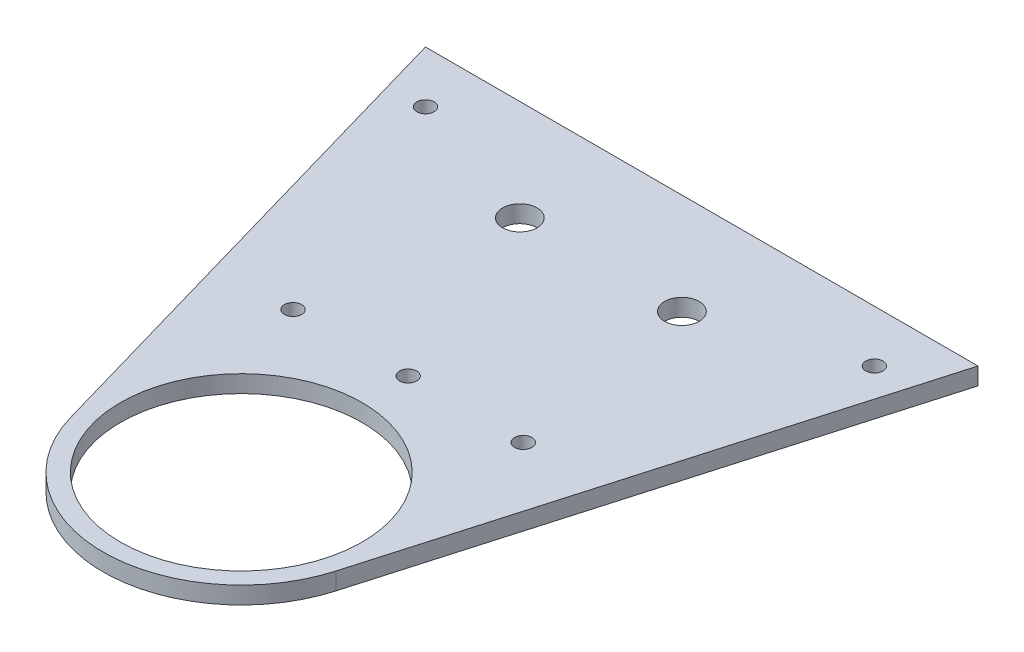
ISO-10303-21;
HEADER;
FILE_DESCRIPTION(('STEP AP214'),'2;1');
FILE_NAME('part.step','',(''),(''),'','','');
FILE_SCHEMA(('AUTOMOTIVE_DESIGN { 1 0 10303 214 1 1 1 1 }'));
ENDSEC;
DATA;
#1=APPLICATION_CONTEXT('core data for automotive mechanical design processes');
#2=APPLICATION_PROTOCOL_DEFINITION('international standard','automotive_design',2000,#1);
#3=PRODUCT_CONTEXT('',#1,'mechanical');
#4=PRODUCT('Part','Part','',(#3));
#5=PRODUCT_RELATED_PRODUCT_CATEGORY('part','',(#4));
#6=PRODUCT_DEFINITION_FORMATION('','',#4);
#7=PRODUCT_DEFINITION_CONTEXT('part definition',#1,'design');
#8=PRODUCT_DEFINITION('design','',#6,#7);
#9=PRODUCT_DEFINITION_SHAPE('','',#8);
#10=(LENGTH_UNIT() NAMED_UNIT(*) SI_UNIT(.MILLI.,.METRE.));
#11=(NAMED_UNIT(*) PLANE_ANGLE_UNIT() SI_UNIT($,.RADIAN.));
#12=(NAMED_UNIT(*) SI_UNIT($,.STERADIAN.) SOLID_ANGLE_UNIT());
#13=UNCERTAINTY_MEASURE_WITH_UNIT(LENGTH_MEASURE(1.E-05),#10,'distance_accuracy_value','');
#14=(GEOMETRIC_REPRESENTATION_CONTEXT(3) GLOBAL_UNCERTAINTY_ASSIGNED_CONTEXT((#13)) GLOBAL_UNIT_ASSIGNED_CONTEXT((#10,
#11,#12)) REPRESENTATION_CONTEXT('',''));
#15=CARTESIAN_POINT('',(0.,0.,0.));
#16=DIRECTION('',(0.,0.,1.));
#17=DIRECTION('',(1.,0.,0.));
#18=AXIS2_PLACEMENT_3D('',#15,#16,#17);
#19=CARTESIAN_POINT('',(0.,3.,0.));
#20=DIRECTION('',(0.,1.,0.));
#21=DIRECTION('',(0.,0.,1.));
#22=AXIS2_PLACEMENT_3D('',#19,#20,#21);
#23=PLANE('',#22);
#24=CARTESIAN_POINT('',(20.,3.,-28.9898972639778));
#25=DIRECTION('',(0.,1.,0.));
#26=DIRECTION('',(0.,0.,1.));
#27=AXIS2_PLACEMENT_3D('',#24,#25,#26);
#28=CIRCLE('',#27,1.5);
#29=CARTESIAN_POINT('',(20.,3.,-27.4898972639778));
#30=VERTEX_POINT('',#29);
#31=EDGE_CURVE('E208',#30,#30,#28,.T.);
#32=ORIENTED_EDGE('',*,*,#31,.F.);
#33=EDGE_LOOP('',(#32));
#34=FACE_BOUND('',#33,.T.);
#35=CARTESIAN_POINT('',(-20.,3.,-28.9898972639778));
#36=DIRECTION('',(0.,1.,0.));
#37=DIRECTION('',(0.,0.,1.));
#38=AXIS2_PLACEMENT_3D('',#35,#36,#37);
#39=CIRCLE('',#38,1.5);
#40=CARTESIAN_POINT('',(-20.,3.,-27.4898972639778));
#41=VERTEX_POINT('',#40);
#42=EDGE_CURVE('E229',#41,#41,#39,.T.);
#43=ORIENTED_EDGE('',*,*,#42,.F.);
#44=EDGE_LOOP('',(#43));
#45=FACE_BOUND('',#44,.T.);
#46=CARTESIAN_POINT('',(39.,3.,-71.));
#47=DIRECTION('',(0.,1.,0.));
#48=DIRECTION('',(0.,0.,1.));
#49=AXIS2_PLACEMENT_3D('',#46,#47,#48);
#50=CIRCLE('',#49,1.5);
#51=CARTESIAN_POINT('',(39.,3.,-69.5));
#52=VERTEX_POINT('',#51);
#53=EDGE_CURVE('E216',#52,#52,#50,.T.);
#54=ORIENTED_EDGE('',*,*,#53,.F.);
#55=EDGE_LOOP('',(#54));
#56=FACE_BOUND('',#55,.T.);
#57=CARTESIAN_POINT('',(-39.,3.,-71.));
#58=DIRECTION('',(0.,1.,0.));
#59=DIRECTION('',(0.,0.,1.));
#60=AXIS2_PLACEMENT_3D('',#57,#58,#59);
#61=CIRCLE('',#60,1.5);
#62=CARTESIAN_POINT('',(-39.,3.,-69.5));
#63=VERTEX_POINT('',#62);
#64=EDGE_CURVE('E212',#63,#63,#61,.T.);
#65=ORIENTED_EDGE('',*,*,#64,.F.);
#66=EDGE_LOOP('',(#65));
#67=FACE_BOUND('',#66,.T.);
#68=CARTESIAN_POINT('',(0.,3.,-28.9898972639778));
#69=DIRECTION('',(0.,1.,0.));
#70=DIRECTION('',(0.,0.,1.));
#71=AXIS2_PLACEMENT_3D('',#68,#69,#70);
#72=CIRCLE('',#71,1.5);
#73=CARTESIAN_POINT('',(0.,3.,-27.4898972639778));
#74=VERTEX_POINT('',#73);
#75=EDGE_CURVE('E235',#74,#74,#72,.T.);
#76=ORIENTED_EDGE('',*,*,#75,.F.);
#77=EDGE_LOOP('',(#76));
#78=FACE_BOUND('',#77,.T.);
#79=CARTESIAN_POINT('',(14.06123517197,3.,-62.4905899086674));
#80=DIRECTION('',(0.,1.,0.));
#81=DIRECTION('',(0.,0.,1.));
#82=AXIS2_PLACEMENT_3D('',#79,#80,#81);
#83=CIRCLE('',#82,3.);
#84=CARTESIAN_POINT('',(14.06123517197,3.,-59.4905899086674));
#85=VERTEX_POINT('',#84);
#86=EDGE_CURVE('E136',#85,#85,#83,.T.);
#87=ORIENTED_EDGE('',*,*,#86,.F.);
#88=EDGE_LOOP('',(#87));
#89=FACE_BOUND('',#88,.T.);
#90=CARTESIAN_POINT('',(-14.0911002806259,3.,-62.4905899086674));
#91=DIRECTION('',(0.,1.,0.));
#92=DIRECTION('',(0.,0.,1.));
#93=AXIS2_PLACEMENT_3D('',#90,#91,#92);
#94=CIRCLE('',#93,3.);
#95=CARTESIAN_POINT('',(-14.0911002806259,3.,-59.4905899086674));
#96=VERTEX_POINT('',#95);
#97=EDGE_CURVE('E126',#96,#96,#94,.T.);
#98=ORIENTED_EDGE('',*,*,#97,.F.);
#99=EDGE_LOOP('',(#98));
#100=FACE_BOUND('',#99,.T.);
#101=DIRECTION('',(0.276592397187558,0.,0.96098732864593));
#102=VECTOR('',#101,1.);
#103=CARTESIAN_POINT('',(-48.,3.,-80.));
#104=LINE('',#103,#102);
#105=CARTESIAN_POINT('',(-48.,3.,-80.));
#106=VERTEX_POINT('',#105);
#107=CARTESIAN_POINT('',(-23.0636958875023,3.,6.63821753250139));
#108=VERTEX_POINT('',#107);
#109=EDGE_CURVE('E99',#106,#108,#104,.T.);
#110=ORIENTED_EDGE('',*,*,#109,.T.);
#111=CARTESIAN_POINT('',(0.,3.,0.));
#112=DIRECTION('',(0.,1.,0.));
#113=DIRECTION('',(0.,0.,1.));
#114=AXIS2_PLACEMENT_3D('',#111,#112,#113);
#115=CIRCLE('',#114,24.);
#116=CARTESIAN_POINT('',(23.0636958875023,3.,6.63821753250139));
#117=VERTEX_POINT('',#116);
#118=EDGE_CURVE('E93',#108,#117,#115,.T.);
#119=ORIENTED_EDGE('',*,*,#118,.T.);
#120=DIRECTION('',(0.276592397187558,0.,-0.96098732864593));
#121=VECTOR('',#120,1.);
#122=CARTESIAN_POINT('',(48.,3.,-80.));
#123=LINE('',#122,#121);
#124=CARTESIAN_POINT('',(48.,3.,-80.));
#125=VERTEX_POINT('',#124);
#126=EDGE_CURVE('E96',#117,#125,#123,.T.);
#127=ORIENTED_EDGE('',*,*,#126,.T.);
#128=DIRECTION('',(-1.,0.,0.));
#129=VECTOR('',#128,1.);
#130=CARTESIAN_POINT('',(0.,3.,-80.));
#131=LINE('',#130,#129);
#132=EDGE_CURVE('E65',#125,#106,#131,.T.);
#133=ORIENTED_EDGE('',*,*,#132,.T.);
#134=EDGE_LOOP('',(#110,#119,#127,#133));
#135=FACE_BOUND('',#134,.T.);
#136=CARTESIAN_POINT('',(0.,3.,0.));
#137=DIRECTION('',(0.,1.,0.));
#138=DIRECTION('',(0.,0.,1.));
#139=AXIS2_PLACEMENT_3D('',#136,#137,#138);
#140=CIRCLE('',#139,21.);
#141=CARTESIAN_POINT('',(0.,3.,21.));
#142=VERTEX_POINT('',#141);
#143=EDGE_CURVE('E117',#142,#142,#140,.T.);
#144=ORIENTED_EDGE('',*,*,#143,.F.);
#145=EDGE_LOOP('',(#144));
#146=FACE_BOUND('',#145,.T.);
#147=ADVANCED_FACE('F46',(#34,#45,#56,#67,#78,#89,#100,#135,#146),#23,.T.);
#148=CARTESIAN_POINT('',(0.,0.,0.));
#149=DIRECTION('',(0.,1.,0.));
#150=DIRECTION('',(0.,0.,1.));
#151=AXIS2_PLACEMENT_3D('',#148,#149,#150);
#152=PLANE('',#151);
#153=CARTESIAN_POINT('',(20.,0.,-28.9898972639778));
#154=DIRECTION('',(0.,-1.,0.));
#155=DIRECTION('',(0.,0.,-1.));
#156=AXIS2_PLACEMENT_3D('',#153,#154,#155);
#157=CIRCLE('',#156,1.5);
#158=CARTESIAN_POINT('',(20.,0.,-30.4898972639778));
#159=VERTEX_POINT('',#158);
#160=EDGE_CURVE('E211',#159,#159,#157,.T.);
#161=ORIENTED_EDGE('',*,*,#160,.F.);
#162=EDGE_LOOP('',(#161));
#163=FACE_BOUND('',#162,.T.);
#164=CARTESIAN_POINT('',(-20.,0.,-28.9898972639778));
#165=DIRECTION('',(0.,-1.,0.));
#166=DIRECTION('',(0.,0.,-1.));
#167=AXIS2_PLACEMENT_3D('',#164,#165,#166);
#168=CIRCLE('',#167,1.5);
#169=CARTESIAN_POINT('',(-20.,0.,-30.4898972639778));
#170=VERTEX_POINT('',#169);
#171=EDGE_CURVE('E213',#170,#170,#168,.T.);
#172=ORIENTED_EDGE('',*,*,#171,.F.);
#173=EDGE_LOOP('',(#172));
#174=FACE_BOUND('',#173,.T.);
#175=CARTESIAN_POINT('',(39.,0.,-71.));
#176=DIRECTION('',(0.,-1.,0.));
#177=DIRECTION('',(0.,0.,-1.));
#178=AXIS2_PLACEMENT_3D('',#175,#176,#177);
#179=CIRCLE('',#178,1.5);
#180=CARTESIAN_POINT('',(39.,0.,-72.5));
#181=VERTEX_POINT('',#180);
#182=EDGE_CURVE('E219',#181,#181,#179,.T.);
#183=ORIENTED_EDGE('',*,*,#182,.F.);
#184=EDGE_LOOP('',(#183));
#185=FACE_BOUND('',#184,.T.);
#186=CARTESIAN_POINT('',(-39.,0.,-71.));
#187=DIRECTION('',(0.,-1.,0.));
#188=DIRECTION('',(0.,0.,-1.));
#189=AXIS2_PLACEMENT_3D('',#186,#187,#188);
#190=CIRCLE('',#189,1.5);
#191=CARTESIAN_POINT('',(-39.,0.,-72.5));
#192=VERTEX_POINT('',#191);
#193=EDGE_CURVE('E224',#192,#192,#190,.T.);
#194=ORIENTED_EDGE('',*,*,#193,.F.);
#195=EDGE_LOOP('',(#194));
#196=FACE_BOUND('',#195,.T.);
#197=CARTESIAN_POINT('',(0.,0.,-28.9898972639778));
#198=DIRECTION('',(0.,-1.,0.));
#199=DIRECTION('',(0.,0.,-1.));
#200=AXIS2_PLACEMENT_3D('',#197,#198,#199);
#201=CIRCLE('',#200,1.5);
#202=CARTESIAN_POINT('',(0.,0.,-30.4898972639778));
#203=VERTEX_POINT('',#202);
#204=EDGE_CURVE('E233',#203,#203,#201,.T.);
#205=ORIENTED_EDGE('',*,*,#204,.F.);
#206=EDGE_LOOP('',(#205));
#207=FACE_BOUND('',#206,.T.);
#208=CARTESIAN_POINT('',(14.06123517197,0.,-62.4905899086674));
#209=DIRECTION('',(0.,1.,0.));
#210=DIRECTION('',(0.,0.,1.));
#211=AXIS2_PLACEMENT_3D('',#208,#209,#210);
#212=CIRCLE('',#211,3.);
#213=CARTESIAN_POINT('',(14.06123517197,0.,-59.4905899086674));
#214=VERTEX_POINT('',#213);
#215=EDGE_CURVE('E50',#214,#214,#212,.T.);
#216=ORIENTED_EDGE('',*,*,#215,.T.);
#217=EDGE_LOOP('',(#216));
#218=FACE_BOUND('',#217,.T.);
#219=CARTESIAN_POINT('',(-14.0911002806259,0.,-62.4905899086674));
#220=DIRECTION('',(0.,1.,0.));
#221=DIRECTION('',(0.,0.,1.));
#222=AXIS2_PLACEMENT_3D('',#219,#220,#221);
#223=CIRCLE('',#222,3.);
#224=CARTESIAN_POINT('',(-14.0911002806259,0.,-59.4905899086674));
#225=VERTEX_POINT('',#224);
#226=EDGE_CURVE('E123',#225,#225,#223,.T.);
#227=ORIENTED_EDGE('',*,*,#226,.T.);
#228=EDGE_LOOP('',(#227));
#229=FACE_BOUND('',#228,.T.);
#230=DIRECTION('',(0.276592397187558,0.,0.96098732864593));
#231=VECTOR('',#230,1.);
#232=CARTESIAN_POINT('',(-48.,0.,-80.));
#233=LINE('',#232,#231);
#234=CARTESIAN_POINT('',(-48.,0.,-80.));
#235=VERTEX_POINT('',#234);
#236=CARTESIAN_POINT('',(-23.0636958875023,0.,6.63821753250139));
#237=VERTEX_POINT('',#236);
#238=EDGE_CURVE('E114',#235,#237,#233,.T.);
#239=ORIENTED_EDGE('',*,*,#238,.F.);
#240=DIRECTION('',(-1.,0.,0.));
#241=VECTOR('',#240,1.);
#242=CARTESIAN_POINT('',(0.,0.,-80.));
#243=LINE('',#242,#241);
#244=CARTESIAN_POINT('',(48.,0.,-80.));
#245=VERTEX_POINT('',#244);
#246=EDGE_CURVE('E82',#245,#235,#243,.T.);
#247=ORIENTED_EDGE('',*,*,#246,.F.);
#248=DIRECTION('',(0.276592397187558,0.,-0.96098732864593));
#249=VECTOR('',#248,1.);
#250=CARTESIAN_POINT('',(48.,0.,-80.));
#251=LINE('',#250,#249);
#252=CARTESIAN_POINT('',(23.0636958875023,0.,6.63821753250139));
#253=VERTEX_POINT('',#252);
#254=EDGE_CURVE('E119',#253,#245,#251,.T.);
#255=ORIENTED_EDGE('',*,*,#254,.F.);
#256=CARTESIAN_POINT('',(0.,0.,0.));
#257=DIRECTION('',(0.,1.,0.));
#258=DIRECTION('',(0.,0.,1.));
#259=AXIS2_PLACEMENT_3D('',#256,#257,#258);
#260=CIRCLE('',#259,24.);
#261=EDGE_CURVE('E104',#237,#253,#260,.T.);
#262=ORIENTED_EDGE('',*,*,#261,.F.);
#263=EDGE_LOOP('',(#239,#247,#255,#262));
#264=FACE_BOUND('',#263,.T.);
#265=CARTESIAN_POINT('',(0.,0.,0.));
#266=DIRECTION('',(0.,1.,0.));
#267=DIRECTION('',(0.,0.,1.));
#268=AXIS2_PLACEMENT_3D('',#265,#266,#267);
#269=CIRCLE('',#268,21.);
#270=CARTESIAN_POINT('',(0.,0.,21.));
#271=VERTEX_POINT('',#270);
#272=EDGE_CURVE('E125',#271,#271,#269,.T.);
#273=ORIENTED_EDGE('',*,*,#272,.T.);
#274=EDGE_LOOP('',(#273));
#275=FACE_BOUND('',#274,.T.);
#276=ADVANCED_FACE('F146',(#163,#174,#185,#196,#207,#218,#229,#264,#275),#152,.F.);
#277=CARTESIAN_POINT('',(-48.,3.,-80.));
#278=DIRECTION('',(0.96098732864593,0.,-0.276592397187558));
#279=DIRECTION('',(-0.276592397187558,0.,-0.96098732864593));
#280=AXIS2_PLACEMENT_3D('',#277,#278,#279);
#281=PLANE('',#280);
#282=ORIENTED_EDGE('',*,*,#238,.T.);
#283=DIRECTION('',(0.,-1.,0.));
#284=VECTOR('',#283,1.);
#285=CARTESIAN_POINT('',(-23.0636958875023,3.,6.63821753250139));
#286=LINE('',#285,#284);
#287=EDGE_CURVE('E13',#108,#237,#286,.T.);
#288=ORIENTED_EDGE('',*,*,#287,.F.);
#289=ORIENTED_EDGE('',*,*,#109,.F.);
#290=DIRECTION('',(0.,-1.,0.));
#291=VECTOR('',#290,1.);
#292=CARTESIAN_POINT('',(-48.,3.,-80.));
#293=LINE('',#292,#291);
#294=EDGE_CURVE('E110',#106,#235,#293,.T.);
#295=ORIENTED_EDGE('',*,*,#294,.T.);
#296=EDGE_LOOP('',(#282,#288,#289,#295));
#297=FACE_BOUND('',#296,.T.);
#298=ADVANCED_FACE('F48',(#297),#281,.F.);
#299=CARTESIAN_POINT('',(0.,3.,0.));
#300=DIRECTION('',(0.,-1.,0.));
#301=DIRECTION('',(0.,0.,-1.));
#302=AXIS2_PLACEMENT_3D('',#299,#300,#301);
#303=CYLINDRICAL_SURFACE('',#302,24.);
#304=ORIENTED_EDGE('',*,*,#261,.T.);
#305=DIRECTION('',(0.,-1.,0.));
#306=VECTOR('',#305,1.);
#307=CARTESIAN_POINT('',(23.0636958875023,3.,6.63821753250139));
#308=LINE('',#307,#306);
#309=EDGE_CURVE('E56',#117,#253,#308,.T.);
#310=ORIENTED_EDGE('',*,*,#309,.F.);
#311=ORIENTED_EDGE('',*,*,#118,.F.);
#312=ORIENTED_EDGE('',*,*,#287,.T.);
#313=EDGE_LOOP('',(#304,#310,#311,#312));
#314=FACE_BOUND('',#313,.T.);
#315=ADVANCED_FACE('F103',(#314),#303,.T.);
#316=CARTESIAN_POINT('',(48.,3.,-80.));
#317=DIRECTION('',(-0.96098732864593,0.,-0.276592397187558));
#318=DIRECTION('',(-0.276592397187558,0.,0.96098732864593));
#319=AXIS2_PLACEMENT_3D('',#316,#317,#318);
#320=PLANE('',#319);
#321=ORIENTED_EDGE('',*,*,#254,.T.);
#322=DIRECTION('',(0.,-1.,0.));
#323=VECTOR('',#322,1.);
#324=CARTESIAN_POINT('',(48.,3.,-80.));
#325=LINE('',#324,#323);
#326=EDGE_CURVE('E106',#125,#245,#325,.T.);
#327=ORIENTED_EDGE('',*,*,#326,.F.);
#328=ORIENTED_EDGE('',*,*,#126,.F.);
#329=ORIENTED_EDGE('',*,*,#309,.T.);
#330=EDGE_LOOP('',(#321,#327,#328,#329));
#331=FACE_BOUND('',#330,.T.);
#332=ADVANCED_FACE('F108',(#331),#320,.F.);
#333=CARTESIAN_POINT('',(0.,3.,-80.));
#334=DIRECTION('',(0.,0.,1.));
#335=DIRECTION('',(1.,0.,0.));
#336=AXIS2_PLACEMENT_3D('',#333,#334,#335);
#337=PLANE('',#336);
#338=ORIENTED_EDGE('',*,*,#246,.T.);
#339=ORIENTED_EDGE('',*,*,#294,.F.);
#340=ORIENTED_EDGE('',*,*,#132,.F.);
#341=ORIENTED_EDGE('',*,*,#326,.T.);
#342=EDGE_LOOP('',(#338,#339,#340,#341));
#343=FACE_BOUND('',#342,.T.);
#344=ADVANCED_FACE('F159',(#343),#337,.F.);
#345=CARTESIAN_POINT('',(0.,3.,0.));
#346=DIRECTION('',(0.,-1.,0.));
#347=DIRECTION('',(0.,0.,-1.));
#348=AXIS2_PLACEMENT_3D('',#345,#346,#347);
#349=CYLINDRICAL_SURFACE('',#348,21.);
#350=ORIENTED_EDGE('',*,*,#143,.T.);
#351=EDGE_LOOP('',(#350));
#352=FACE_BOUND('',#351,.T.);
#353=ORIENTED_EDGE('',*,*,#272,.F.);
#354=EDGE_LOOP('',(#353));
#355=FACE_BOUND('',#354,.T.);
#356=ADVANCED_FACE('F143',(#352,#355),#349,.F.);
#357=CARTESIAN_POINT('',(-14.0911002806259,-33.,-62.4905899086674));
#358=DIRECTION('',(0.,1.,0.));
#359=DIRECTION('',(0.,0.,1.));
#360=AXIS2_PLACEMENT_3D('',#357,#358,#359);
#361=CYLINDRICAL_SURFACE('',#360,3.);
#362=ORIENTED_EDGE('',*,*,#97,.T.);
#363=EDGE_LOOP('',(#362));
#364=FACE_BOUND('',#363,.T.);
#365=ORIENTED_EDGE('',*,*,#226,.F.);
#366=EDGE_LOOP('',(#365));
#367=FACE_BOUND('',#366,.T.);
#368=ADVANCED_FACE('F173',(#364,#367),#361,.F.);
#369=CARTESIAN_POINT('',(14.06123517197,-33.,-62.4905899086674));
#370=DIRECTION('',(0.,1.,0.));
#371=DIRECTION('',(0.,0.,1.));
#372=AXIS2_PLACEMENT_3D('',#369,#370,#371);
#373=CYLINDRICAL_SURFACE('',#372,3.);
#374=ORIENTED_EDGE('',*,*,#86,.T.);
#375=EDGE_LOOP('',(#374));
#376=FACE_BOUND('',#375,.T.);
#377=ORIENTED_EDGE('',*,*,#215,.F.);
#378=EDGE_LOOP('',(#377));
#379=FACE_BOUND('',#378,.T.);
#380=ADVANCED_FACE('F177',(#376,#379),#373,.F.);
#381=CARTESIAN_POINT('',(0.,10.,-28.9898972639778));
#382=DIRECTION('',(0.,-1.,0.));
#383=DIRECTION('',(0.,0.,-1.));
#384=AXIS2_PLACEMENT_3D('',#381,#382,#383);
#385=CYLINDRICAL_SURFACE('',#384,1.5);
#386=ORIENTED_EDGE('',*,*,#75,.T.);
#387=EDGE_LOOP('',(#386));
#388=FACE_BOUND('',#387,.T.);
#389=ORIENTED_EDGE('',*,*,#204,.T.);
#390=EDGE_LOOP('',(#389));
#391=FACE_BOUND('',#390,.T.);
#392=ADVANCED_FACE('F181',(#388,#391),#385,.F.);
#393=CARTESIAN_POINT('',(-39.,10.,-71.));
#394=DIRECTION('',(0.,-1.,0.));
#395=DIRECTION('',(0.,0.,-1.));
#396=AXIS2_PLACEMENT_3D('',#393,#394,#395);
#397=CYLINDRICAL_SURFACE('',#396,1.5);
#398=ORIENTED_EDGE('',*,*,#64,.T.);
#399=EDGE_LOOP('',(#398));
#400=FACE_BOUND('',#399,.T.);
#401=ORIENTED_EDGE('',*,*,#193,.T.);
#402=EDGE_LOOP('',(#401));
#403=FACE_BOUND('',#402,.T.);
#404=ADVANCED_FACE('F188',(#400,#403),#397,.F.);
#405=CARTESIAN_POINT('',(39.,10.,-71.));
#406=DIRECTION('',(0.,-1.,0.));
#407=DIRECTION('',(0.,0.,-1.));
#408=AXIS2_PLACEMENT_3D('',#405,#406,#407);
#409=CYLINDRICAL_SURFACE('',#408,1.5);
#410=ORIENTED_EDGE('',*,*,#53,.T.);
#411=EDGE_LOOP('',(#410));
#412=FACE_BOUND('',#411,.T.);
#413=ORIENTED_EDGE('',*,*,#182,.T.);
#414=EDGE_LOOP('',(#413));
#415=FACE_BOUND('',#414,.T.);
#416=ADVANCED_FACE('F192',(#412,#415),#409,.F.);
#417=CARTESIAN_POINT('',(-20.,10.,-28.9898972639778));
#418=DIRECTION('',(0.,-1.,0.));
#419=DIRECTION('',(0.,0.,-1.));
#420=AXIS2_PLACEMENT_3D('',#417,#418,#419);
#421=CYLINDRICAL_SURFACE('',#420,1.5);
#422=ORIENTED_EDGE('',*,*,#42,.T.);
#423=EDGE_LOOP('',(#422));
#424=FACE_BOUND('',#423,.T.);
#425=ORIENTED_EDGE('',*,*,#171,.T.);
#426=EDGE_LOOP('',(#425));
#427=FACE_BOUND('',#426,.T.);
#428=ADVANCED_FACE('F196',(#424,#427),#421,.F.);
#429=CARTESIAN_POINT('',(20.,10.,-28.9898972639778));
#430=DIRECTION('',(0.,-1.,0.));
#431=DIRECTION('',(0.,0.,-1.));
#432=AXIS2_PLACEMENT_3D('',#429,#430,#431);
#433=CYLINDRICAL_SURFACE('',#432,1.5);
#434=ORIENTED_EDGE('',*,*,#31,.T.);
#435=EDGE_LOOP('',(#434));
#436=FACE_BOUND('',#435,.T.);
#437=ORIENTED_EDGE('',*,*,#160,.T.);
#438=EDGE_LOOP('',(#437));
#439=FACE_BOUND('',#438,.T.);
#440=ADVANCED_FACE('F200',(#436,#439),#433,.F.);
#441=CLOSED_SHELL('',(#147,#276,#298,#315,#332,#344,#356,#368,#380,#392,#404,#416,#428,#440));
#442=MANIFOLD_SOLID_BREP('B2',#441);
#443=ADVANCED_BREP_SHAPE_REPRESENTATION('',(#18,#442),#14);
#444=SHAPE_DEFINITION_REPRESENTATION(#9,#443);
ENDSEC;
END-ISO-10303-21;
